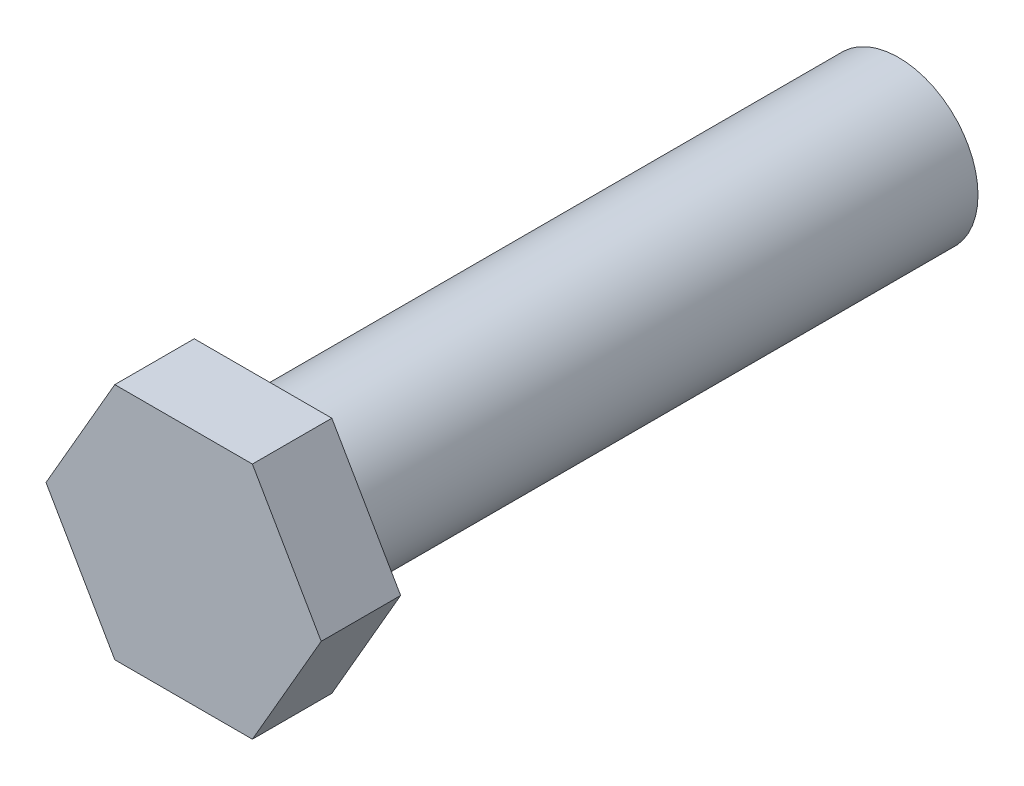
from build123d import *

# Parameters (mm, degrees)
SKETCH1_R      = 5
EXTRUDE1_DEPTH = 40
EXTRUDE2_DEPTH = 5


with BuildPart() as part:
    # Sketch1 → Extrude1 (new body)
    with BuildSketch(Plane.XY):
        Circle(SKETCH1_R)
    extrude(amount=EXTRUDE1_DEPTH)

    # Sketch2 → Extrude2 (add)
    with BuildSketch(Plane.XY.offset(40)):
        Polygon((8.660254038, 0), (4.330127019, 7.5), (-4.330127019, 7.5), (-8.660254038, 0), (-4.330127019, -7.5), (4.330127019, -7.5), align=None)
    extrude(amount=EXTRUDE2_DEPTH)


solid = part.part
